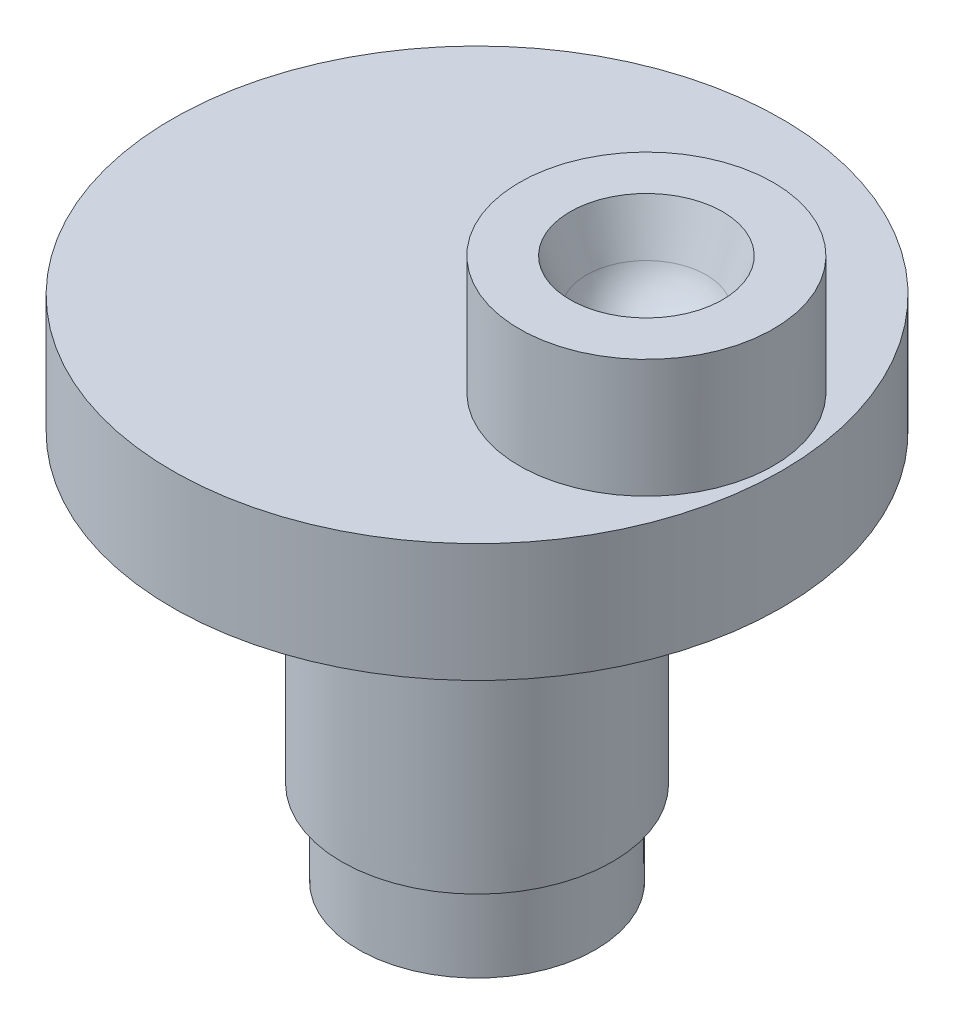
ISO-10303-21;
HEADER;
FILE_DESCRIPTION(('STEP AP214'),'2;1');
FILE_NAME('part.step','',(''),(''),'','','');
FILE_SCHEMA(('AUTOMOTIVE_DESIGN { 1 0 10303 214 1 1 1 1 }'));
ENDSEC;
DATA;
#1=APPLICATION_CONTEXT('core data for automotive mechanical design processes');
#2=APPLICATION_PROTOCOL_DEFINITION('international standard','automotive_design',2000,#1);
#3=PRODUCT_CONTEXT('',#1,'mechanical');
#4=PRODUCT('Part','Part','',(#3));
#5=PRODUCT_RELATED_PRODUCT_CATEGORY('part','',(#4));
#6=PRODUCT_DEFINITION_FORMATION('','',#4);
#7=PRODUCT_DEFINITION_CONTEXT('part definition',#1,'design');
#8=PRODUCT_DEFINITION('design','',#6,#7);
#9=PRODUCT_DEFINITION_SHAPE('','',#8);
#10=(LENGTH_UNIT() NAMED_UNIT(*) SI_UNIT(.MILLI.,.METRE.));
#11=(NAMED_UNIT(*) PLANE_ANGLE_UNIT() SI_UNIT($,.RADIAN.));
#12=(NAMED_UNIT(*) SI_UNIT($,.STERADIAN.) SOLID_ANGLE_UNIT());
#13=UNCERTAINTY_MEASURE_WITH_UNIT(LENGTH_MEASURE(1.E-05),#10,'distance_accuracy_value','');
#14=(GEOMETRIC_REPRESENTATION_CONTEXT(3) GLOBAL_UNCERTAINTY_ASSIGNED_CONTEXT((#13)) GLOBAL_UNIT_ASSIGNED_CONTEXT((#10,
#11,#12)) REPRESENTATION_CONTEXT('',''));
#15=CARTESIAN_POINT('',(0.,0.,0.));
#16=DIRECTION('',(0.,0.,1.));
#17=DIRECTION('',(1.,0.,0.));
#18=AXIS2_PLACEMENT_3D('',#15,#16,#17);
#19=CARTESIAN_POINT('',(0.,0.,0.));
#20=DIRECTION('',(0.,1.,0.));
#21=DIRECTION('',(-1.,0.,0.));
#22=AXIS2_PLACEMENT_3D('',#19,#20,#21);
#23=PLANE('',#22);
#24=CARTESIAN_POINT('',(20.,0.,0.));
#25=DIRECTION('',(0.,1.,0.));
#26=DIRECTION('',(-1.,0.,0.));
#27=AXIS2_PLACEMENT_3D('',#24,#25,#26);
#28=CIRCLE('',#27,15.0000820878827);
#29=CARTESIAN_POINT('',(4.99991791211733,0.,0.));
#30=VERTEX_POINT('',#29);
#31=EDGE_CURVE('E10',#30,#30,#28,.T.);
#32=ORIENTED_EDGE('',*,*,#31,.F.);
#33=EDGE_LOOP('',(#32));
#34=FACE_BOUND('',#33,.T.);
#35=CARTESIAN_POINT('',(0.,0.,0.));
#36=DIRECTION('',(0.,-1.,0.));
#37=DIRECTION('',(1.,0.,0.));
#38=AXIS2_PLACEMENT_3D('',#35,#36,#37);
#39=CIRCLE('',#38,36.0000264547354);
#40=CARTESIAN_POINT('',(36.0000264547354,0.,0.));
#41=VERTEX_POINT('',#40);
#42=EDGE_CURVE('E38',#41,#41,#39,.T.);
#43=ORIENTED_EDGE('',*,*,#42,.F.);
#44=EDGE_LOOP('',(#43));
#45=FACE_BOUND('',#44,.T.);
#46=ADVANCED_FACE('F32',(#34,#45),#23,.T.);
#47=CARTESIAN_POINT('',(-1.47451495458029E-13,-60.,0.));
#48=DIRECTION('',(0.,-1.,0.));
#49=DIRECTION('',(1.,0.,0.));
#50=AXIS2_PLACEMENT_3D('',#47,#48,#49);
#51=CYLINDRICAL_SURFACE('',#50,36.0000239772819);
#52=ORIENTED_EDGE('',*,*,#42,.T.);
#53=EDGE_LOOP('',(#52));
#54=FACE_BOUND('',#53,.T.);
#55=CARTESIAN_POINT('',(0.,-13.9999999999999,0.));
#56=DIRECTION('',(0.,-1.,0.));
#57=DIRECTION('',(1.,0.,0.));
#58=AXIS2_PLACEMENT_3D('',#55,#56,#57);
#59=CIRCLE('',#58,36.0000214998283);
#60=CARTESIAN_POINT('',(36.0000214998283,-14.,0.));
#61=VERTEX_POINT('',#60);
#62=EDGE_CURVE('E42',#61,#61,#59,.T.);
#63=ORIENTED_EDGE('',*,*,#62,.F.);
#64=EDGE_LOOP('',(#63));
#65=FACE_BOUND('',#64,.T.);
#66=ADVANCED_FACE('F94',(#54,#65),#51,.T.);
#67=CARTESIAN_POINT('',(36.0000214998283,-14.,0.));
#68=DIRECTION('',(0.,-1.,0.));
#69=DIRECTION('',(1.,0.,0.));
#70=AXIS2_PLACEMENT_3D('',#67,#68,#69);
#71=PLANE('',#70);
#72=ORIENTED_EDGE('',*,*,#62,.T.);
#73=EDGE_LOOP('',(#72));
#74=FACE_BOUND('',#73,.T.);
#75=CARTESIAN_POINT('',(0.,-13.9999999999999,0.));
#76=DIRECTION('',(0.,-1.,0.));
#77=DIRECTION('',(1.,0.,0.));
#78=AXIS2_PLACEMENT_3D('',#75,#76,#77);
#79=CIRCLE('',#78,29.0000800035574);
#80=CARTESIAN_POINT('',(29.0000800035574,-14.,0.));
#81=VERTEX_POINT('',#80);
#82=EDGE_CURVE('E46',#81,#81,#79,.T.);
#83=ORIENTED_EDGE('',*,*,#82,.F.);
#84=EDGE_LOOP('',(#83));
#85=FACE_BOUND('',#84,.T.);
#86=ADVANCED_FACE('F99',(#74,#85),#71,.T.);
#87=CARTESIAN_POINT('',(0.,-12.9999999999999,0.));
#88=DIRECTION('',(0.,-1.,0.));
#89=DIRECTION('',(1.,0.,0.));
#90=AXIS2_PLACEMENT_3D('',#87,#88,#89);
#91=CONICAL_SURFACE('',#90,28.762875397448,0.2329001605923);
#92=ORIENTED_EDGE('',*,*,#82,.T.);
#93=EDGE_LOOP('',(#92));
#94=FACE_BOUND('',#93,.T.);
#95=CARTESIAN_POINT('',(0.,-12.9999999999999,0.));
#96=DIRECTION('',(0.,-1.,0.));
#97=DIRECTION('',(1.,0.,0.));
#98=AXIS2_PLACEMENT_3D('',#95,#96,#97);
#99=CIRCLE('',#98,28.762875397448);
#100=CARTESIAN_POINT('',(28.762875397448,-13.,0.));
#101=VERTEX_POINT('',#100);
#102=EDGE_CURVE('E51',#101,#101,#99,.T.);
#103=ORIENTED_EDGE('',*,*,#102,.F.);
#104=EDGE_LOOP('',(#103));
#105=FACE_BOUND('',#104,.T.);
#106=ADVANCED_FACE('F104',(#94,#105),#91,.F.);
#107=CARTESIAN_POINT('',(28.762875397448,-13.,0.));
#108=DIRECTION('',(0.,-1.,0.));
#109=DIRECTION('',(1.,0.,0.));
#110=AXIS2_PLACEMENT_3D('',#107,#108,#109);
#111=PLANE('',#110);
#112=ORIENTED_EDGE('',*,*,#102,.T.);
#113=EDGE_LOOP('',(#112));
#114=FACE_BOUND('',#113,.T.);
#115=CARTESIAN_POINT('',(0.,-13.,0.));
#116=DIRECTION('',(0.,-1.,0.));
#117=DIRECTION('',(1.,0.,0.));
#118=AXIS2_PLACEMENT_3D('',#115,#116,#117);
#119=CIRCLE('',#118,14.9999999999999);
#120=CARTESIAN_POINT('',(14.9999999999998,-13.,0.));
#121=VERTEX_POINT('',#120);
#122=EDGE_CURVE('E54',#121,#121,#119,.T.);
#123=ORIENTED_EDGE('',*,*,#122,.F.);
#124=EDGE_LOOP('',(#123));
#125=FACE_BOUND('',#124,.T.);
#126=ADVANCED_FACE('F111',(#114,#125),#111,.T.);
#127=CARTESIAN_POINT('',(-1.47451495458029E-13,-60.,0.));
#128=DIRECTION('',(0.,-1.,0.));
#129=DIRECTION('',(1.,0.,0.));
#130=AXIS2_PLACEMENT_3D('',#127,#128,#129);
#131=CYLINDRICAL_SURFACE('',#130,14.9999999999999);
#132=ORIENTED_EDGE('',*,*,#122,.T.);
#133=EDGE_LOOP('',(#132));
#134=FACE_BOUND('',#133,.T.);
#135=CARTESIAN_POINT('',(0.,-17.,0.));
#136=DIRECTION('',(0.,-1.,0.));
#137=DIRECTION('',(1.,0.,0.));
#138=AXIS2_PLACEMENT_3D('',#135,#136,#137);
#139=CIRCLE('',#138,14.9999999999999);
#140=CARTESIAN_POINT('',(14.9999999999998,-17.,0.));
#141=VERTEX_POINT('',#140);
#142=EDGE_CURVE('E57',#141,#141,#139,.T.);
#143=ORIENTED_EDGE('',*,*,#142,.F.);
#144=EDGE_LOOP('',(#143));
#145=FACE_BOUND('',#144,.T.);
#146=ADVANCED_FACE('F115',(#134,#145),#131,.T.);
#147=CARTESIAN_POINT('',(14.9999999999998,-17.,0.));
#148=DIRECTION('',(0.,1.,0.));
#149=DIRECTION('',(-1.,0.,0.));
#150=AXIS2_PLACEMENT_3D('',#147,#148,#149);
#151=PLANE('',#150);
#152=ORIENTED_EDGE('',*,*,#142,.T.);
#153=EDGE_LOOP('',(#152));
#154=FACE_BOUND('',#153,.T.);
#155=CARTESIAN_POINT('',(0.,-17.,0.));
#156=DIRECTION('',(0.,-1.,0.));
#157=DIRECTION('',(1.,0.,0.));
#158=AXIS2_PLACEMENT_3D('',#155,#156,#157);
#159=CIRCLE('',#158,16.0000868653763);
#160=CARTESIAN_POINT('',(16.0000868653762,-17.,0.));
#161=VERTEX_POINT('',#160);
#162=EDGE_CURVE('E60',#161,#161,#159,.T.);
#163=ORIENTED_EDGE('',*,*,#162,.F.);
#164=EDGE_LOOP('',(#163));
#165=FACE_BOUND('',#164,.T.);
#166=ADVANCED_FACE('F119',(#154,#165),#151,.T.);
#167=CARTESIAN_POINT('',(-1.22876246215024E-13,-50.,0.));
#168=DIRECTION('',(0.,1.,0.));
#169=DIRECTION('',(-1.,0.,0.));
#170=AXIS2_PLACEMENT_3D('',#167,#168,#169);
#171=CONICAL_SURFACE('',#170,16.0000659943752,6.32454578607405E-07);
#172=ORIENTED_EDGE('',*,*,#162,.T.);
#173=EDGE_LOOP('',(#172));
#174=FACE_BOUND('',#173,.T.);
#175=CARTESIAN_POINT('',(-1.22876246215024E-13,-50.,0.));
#176=DIRECTION('',(0.,-1.,0.));
#177=DIRECTION('',(1.,0.,0.));
#178=AXIS2_PLACEMENT_3D('',#175,#176,#177);
#179=CIRCLE('',#178,16.0000659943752);
#180=CARTESIAN_POINT('',(16.0000659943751,-50.,0.));
#181=VERTEX_POINT('',#180);
#182=EDGE_CURVE('E63',#181,#181,#179,.T.);
#183=ORIENTED_EDGE('',*,*,#182,.F.);
#184=EDGE_LOOP('',(#183));
#185=FACE_BOUND('',#184,.T.);
#186=ADVANCED_FACE('F123',(#174,#185),#171,.T.);
#187=CARTESIAN_POINT('',(16.0000659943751,-50.,0.));
#188=DIRECTION('',(0.,-1.,0.));
#189=DIRECTION('',(1.,0.,0.));
#190=AXIS2_PLACEMENT_3D('',#187,#188,#189);
#191=PLANE('',#190);
#192=ORIENTED_EDGE('',*,*,#182,.T.);
#193=EDGE_LOOP('',(#192));
#194=FACE_BOUND('',#193,.T.);
#195=CARTESIAN_POINT('',(-1.22876246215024E-13,-50.,0.));
#196=DIRECTION('',(0.,-1.,0.));
#197=DIRECTION('',(1.,0.,0.));
#198=AXIS2_PLACEMENT_3D('',#195,#196,#197);
#199=CIRCLE('',#198,14.0000773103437);
#200=CARTESIAN_POINT('',(14.0000773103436,-50.,0.));
#201=VERTEX_POINT('',#200);
#202=EDGE_CURVE('E66',#201,#201,#199,.T.);
#203=ORIENTED_EDGE('',*,*,#202,.F.);
#204=EDGE_LOOP('',(#203));
#205=FACE_BOUND('',#204,.T.);
#206=ADVANCED_FACE('F127',(#194,#205),#191,.T.);
#207=CARTESIAN_POINT('',(-1.47451495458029E-13,-60.,0.));
#208=DIRECTION('',(0.,1.,0.));
#209=DIRECTION('',(-1.,0.,0.));
#210=AXIS2_PLACEMENT_3D('',#207,#208,#209);
#211=CONICAL_SURFACE('',#210,14.0000564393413,2.08710024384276E-06);
#212=ORIENTED_EDGE('',*,*,#202,.T.);
#213=EDGE_LOOP('',(#212));
#214=FACE_BOUND('',#213,.T.);
#215=CARTESIAN_POINT('',(-1.47451495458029E-13,-60.,0.));
#216=DIRECTION('',(0.,-1.,0.));
#217=DIRECTION('',(1.,0.,0.));
#218=AXIS2_PLACEMENT_3D('',#215,#216,#217);
#219=CIRCLE('',#218,14.0000564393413);
#220=CARTESIAN_POINT('',(14.0000564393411,-60.,0.));
#221=VERTEX_POINT('',#220);
#222=EDGE_CURVE('E69',#221,#221,#219,.T.);
#223=ORIENTED_EDGE('',*,*,#222,.F.);
#224=EDGE_LOOP('',(#223));
#225=FACE_BOUND('',#224,.T.);
#226=ADVANCED_FACE('F131',(#214,#225),#211,.T.);
#227=CARTESIAN_POINT('',(14.0000564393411,-60.,0.));
#228=DIRECTION('',(0.,-1.,0.));
#229=DIRECTION('',(1.,0.,0.));
#230=AXIS2_PLACEMENT_3D('',#227,#228,#229);
#231=PLANE('',#230);
#232=ORIENTED_EDGE('',*,*,#222,.T.);
#233=EDGE_LOOP('',(#232));
#234=FACE_BOUND('',#233,.T.);
#235=ADVANCED_FACE('F135',(#234),#231,.T.);
#236=CARTESIAN_POINT('',(20.,0.,0.));
#237=DIRECTION('',(0.,-1.,0.));
#238=DIRECTION('',(0.,0.,-1.));
#239=AXIS2_PLACEMENT_3D('',#236,#237,#238);
#240=CYLINDRICAL_SURFACE('',#239,15.0000820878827);
#241=CARTESIAN_POINT('',(20.,14.,0.));
#242=DIRECTION('',(0.,-1.,0.));
#243=DIRECTION('',(0.,0.,-1.));
#244=AXIS2_PLACEMENT_3D('',#241,#242,#243);
#245=CIRCLE('',#244,15.0000820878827);
#246=CARTESIAN_POINT('',(20.,14.,-15.0000820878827));
#247=VERTEX_POINT('',#246);
#248=EDGE_CURVE('E72',#247,#247,#245,.T.);
#249=ORIENTED_EDGE('',*,*,#248,.T.);
#250=EDGE_LOOP('',(#249));
#251=FACE_BOUND('',#250,.T.);
#252=ORIENTED_EDGE('',*,*,#31,.T.);
#253=EDGE_LOOP('',(#252));
#254=FACE_BOUND('',#253,.T.);
#255=ADVANCED_FACE('F139',(#251,#254),#240,.T.);
#256=CARTESIAN_POINT('',(29.0105026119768,14.,0.));
#257=DIRECTION('',(0.,1.,0.));
#258=DIRECTION('',(0.,0.,1.));
#259=AXIS2_PLACEMENT_3D('',#256,#257,#258);
#260=PLANE('',#259);
#261=CARTESIAN_POINT('',(20.,14.,0.));
#262=DIRECTION('',(0.,-1.,0.));
#263=DIRECTION('',(0.,0.,-1.));
#264=AXIS2_PLACEMENT_3D('',#261,#262,#263);
#265=CIRCLE('',#264,9.01050261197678);
#266=CARTESIAN_POINT('',(20.,14.,-9.01050261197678));
#267=VERTEX_POINT('',#266);
#268=EDGE_CURVE('E75',#267,#267,#265,.T.);
#269=ORIENTED_EDGE('',*,*,#268,.T.);
#270=EDGE_LOOP('',(#269));
#271=FACE_BOUND('',#270,.T.);
#272=ORIENTED_EDGE('',*,*,#248,.F.);
#273=EDGE_LOOP('',(#272));
#274=FACE_BOUND('',#273,.T.);
#275=ADVANCED_FACE('F91',(#271,#274),#260,.T.);
#276=CARTESIAN_POINT('',(20.,14.,0.));
#277=DIRECTION('',(0.,1.,0.));
#278=DIRECTION('',(0.,0.,1.));
#279=AXIS2_PLACEMENT_3D('',#276,#277,#278);
#280=CONICAL_SURFACE('',#279,9.01050261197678,0.339010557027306);
#281=CARTESIAN_POINT('',(20.,8.50584404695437,0.));
#282=DIRECTION('',(0.,-1.,0.));
#283=DIRECTION('',(0.,0.,-1.));
#284=AXIS2_PLACEMENT_3D('',#281,#282,#283);
#285=CIRCLE('',#284,7.07313127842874);
#286=CARTESIAN_POINT('',(20.,8.50584404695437,-7.07313127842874));
#287=VERTEX_POINT('',#286);
#288=EDGE_CURVE('E78',#287,#287,#285,.T.);
#289=ORIENTED_EDGE('',*,*,#288,.T.);
#290=EDGE_LOOP('',(#289));
#291=FACE_BOUND('',#290,.T.);
#292=ORIENTED_EDGE('',*,*,#268,.F.);
#293=EDGE_LOOP('',(#292));
#294=FACE_BOUND('',#293,.T.);
#295=ADVANCED_FACE('F82',(#291,#294),#280,.F.);
#296=CARTESIAN_POINT('',(20.,11.,0.));
#297=DIRECTION('',(0.,-1.,0.));
#298=DIRECTION('',(1.,0.,0.));
#299=AXIS2_PLACEMENT_3D('',#296,#297,#298);
#300=SPHERICAL_SURFACE('',#299,7.5);
#301=ORIENTED_EDGE('',*,*,#288,.F.);
#302=EDGE_LOOP('',(#301));
#303=FACE_BOUND('',#302,.T.);
#304=ADVANCED_FACE('F85',(#303),#300,.F.);
#305=CLOSED_SHELL('',(#46,#66,#86,#106,#126,#146,#166,#186,#206,#226,#235,#255,#275,#295,#304));
#306=MANIFOLD_SOLID_BREP('B2',#305);
#307=ADVANCED_BREP_SHAPE_REPRESENTATION('',(#18,#306),#14);
#308=SHAPE_DEFINITION_REPRESENTATION(#9,#307);
ENDSEC;
END-ISO-10303-21;
